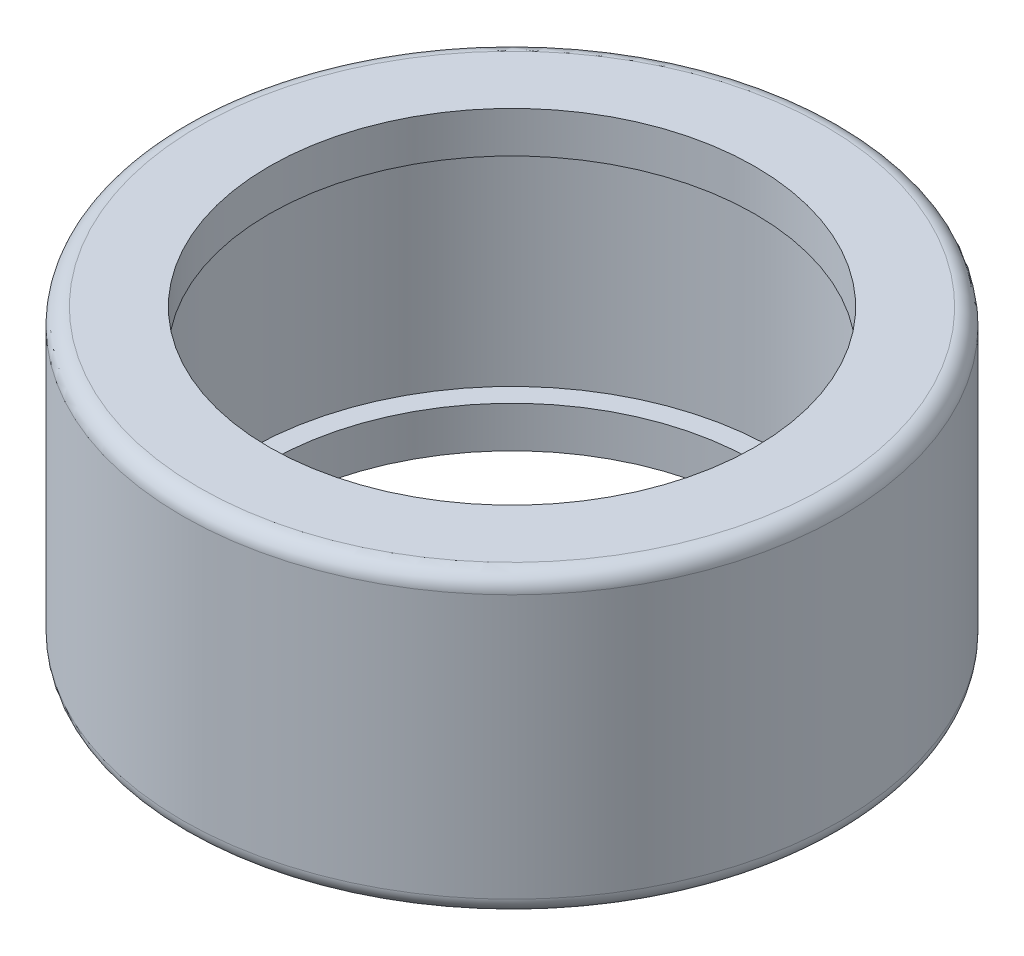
from build123d import *


with BuildPart() as part:
    # Esquisse1 → Base-R_volution (revolve)
    with BuildSketch(Plane.XY, mode=Mode.PRIVATE) as base_r_volution_sk:
        with BuildLine():
            Line((-7.375, -4.5), (-9.5, -4.5))
            ThreePointArc((-9.5, -4.5), (-9.853553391, -4.353553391), (-10, -4))
            Line((-10, -4), (-10, 4))
            ThreePointArc((-10, 4), (-9.853553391, 4.353553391), (-9.5, 4.5))
            Line((-9.5, 4.5), (-7.375, 4.5))
            Line((-7.375, 4.5), (-7.375, 3.25))
            Line((-7.375, 3.25), (-8, 3.25))
            Line((-8, 3.25), (-8, -3.25))
            Line((-8, -3.25), (-7.375, -3.25))
            Line((-7.375, -3.25), (-7.375, -4.5))
        make_face()
    revolve(base_r_volution_sk.sketch.rotate(Axis((0, 0, 0), (0, -1, 0)), 270), axis=Axis((0, 0, 0), (0, -1, 0)))


solid = part.part
